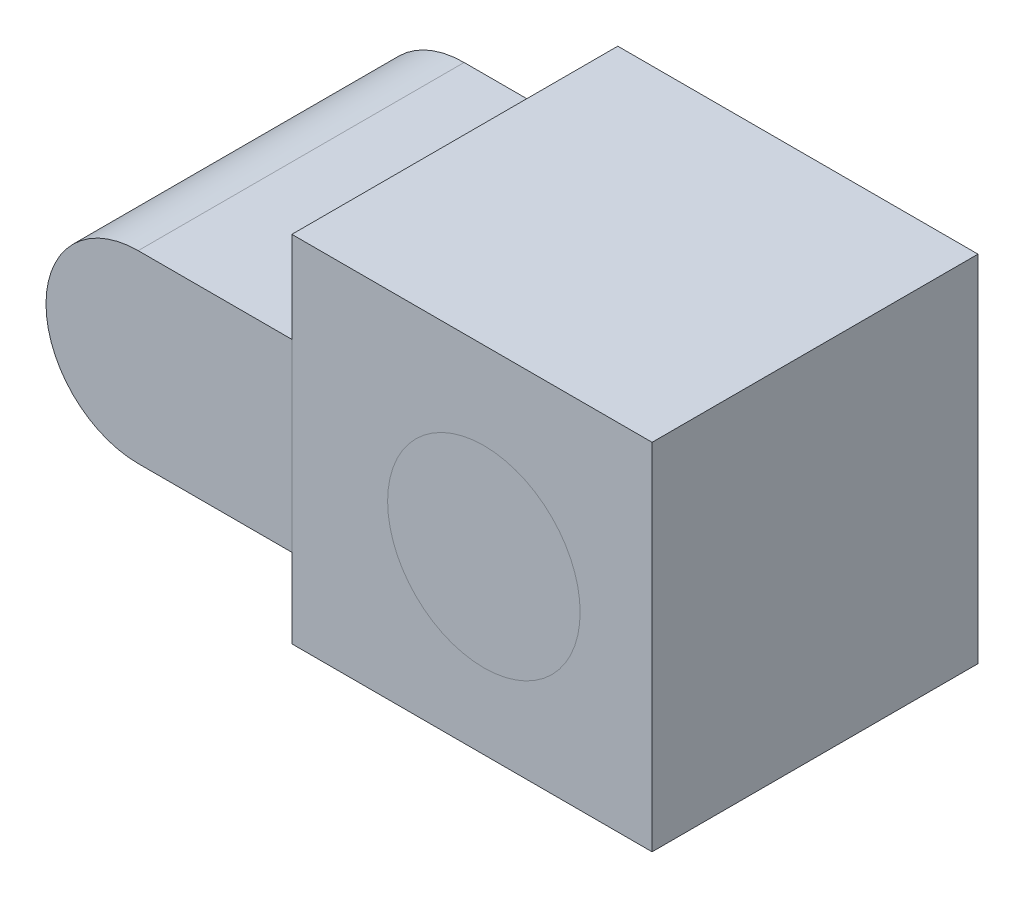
ISO-10303-21;
HEADER;
FILE_DESCRIPTION(('STEP AP214'),'2;1');
FILE_NAME('part.step','',(''),(''),'','','');
FILE_SCHEMA(('AUTOMOTIVE_DESIGN { 1 0 10303 214 1 1 1 1 }'));
ENDSEC;
DATA;
#1=APPLICATION_CONTEXT('core data for automotive mechanical design processes');
#2=APPLICATION_PROTOCOL_DEFINITION('international standard','automotive_design',2000,#1);
#3=PRODUCT_CONTEXT('',#1,'mechanical');
#4=PRODUCT('Part','Part','',(#3));
#5=PRODUCT_RELATED_PRODUCT_CATEGORY('part','',(#4));
#6=PRODUCT_DEFINITION_FORMATION('','',#4);
#7=PRODUCT_DEFINITION_CONTEXT('part definition',#1,'design');
#8=PRODUCT_DEFINITION('design','',#6,#7);
#9=PRODUCT_DEFINITION_SHAPE('','',#8);
#10=(LENGTH_UNIT() NAMED_UNIT(*) SI_UNIT(.MILLI.,.METRE.));
#11=(NAMED_UNIT(*) PLANE_ANGLE_UNIT() SI_UNIT($,.RADIAN.));
#12=(NAMED_UNIT(*) SI_UNIT($,.STERADIAN.) SOLID_ANGLE_UNIT());
#13=UNCERTAINTY_MEASURE_WITH_UNIT(LENGTH_MEASURE(1.E-05),#10,'distance_accuracy_value','');
#14=(GEOMETRIC_REPRESENTATION_CONTEXT(3) GLOBAL_UNCERTAINTY_ASSIGNED_CONTEXT((#13)) GLOBAL_UNIT_ASSIGNED_CONTEXT((#10,
#11,#12)) REPRESENTATION_CONTEXT('',''));
#15=CARTESIAN_POINT('',(0.,0.,0.));
#16=DIRECTION('',(0.,0.,1.));
#17=DIRECTION('',(1.,0.,0.));
#18=AXIS2_PLACEMENT_3D('',#15,#16,#17);
#19=CARTESIAN_POINT('',(38.3061852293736,34.2169341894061,-0.00999999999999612));
#20=DIRECTION('',(0.,0.,1.));
#21=DIRECTION('',(1.,0.,0.));
#22=AXIS2_PLACEMENT_3D('',#19,#20,#21);
#23=CYLINDRICAL_SURFACE('',#22,19.2044359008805);
#24=CARTESIAN_POINT('',(38.3061852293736,34.2169341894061,0.));
#25=DIRECTION('',(0.,0.,1.));
#26=DIRECTION('',(1.,0.,0.));
#27=AXIS2_PLACEMENT_3D('',#24,#25,#26);
#28=CIRCLE('',#27,19.2044359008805);
#29=CARTESIAN_POINT('',(57.5106211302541,34.2169341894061,0.));
#30=VERTEX_POINT('',#29);
#31=EDGE_CURVE('E39',#30,#30,#28,.T.);
#32=ORIENTED_EDGE('',*,*,#31,.T.);
#33=EDGE_LOOP('',(#32));
#34=FACE_BOUND('',#33,.T.);
#35=CARTESIAN_POINT('',(38.3061852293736,34.2169341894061,65.024));
#36=DIRECTION('',(0.,0.,1.));
#37=DIRECTION('',(1.,0.,0.));
#38=AXIS2_PLACEMENT_3D('',#35,#36,#37);
#39=CIRCLE('',#38,19.2044359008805);
#40=CARTESIAN_POINT('',(57.5106211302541,34.2169341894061,65.024));
#41=VERTEX_POINT('',#40);
#42=EDGE_CURVE('E11',#41,#41,#39,.T.);
#43=ORIENTED_EDGE('',*,*,#42,.F.);
#44=EDGE_LOOP('',(#43));
#45=FACE_BOUND('',#44,.T.);
#46=ADVANCED_FACE('F35',(#34,#45),#23,.T.);
#47=CARTESIAN_POINT('',(-30.6603352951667,34.2169341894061,0.));
#48=DIRECTION('',(0.,0.,1.));
#49=DIRECTION('',(1.,0.,0.));
#50=AXIS2_PLACEMENT_3D('',#47,#48,#49);
#51=PLANE('',#50);
#52=ORIENTED_EDGE('',*,*,#31,.F.);
#53=EDGE_LOOP('',(#52));
#54=FACE_BOUND('',#53,.T.);
#55=ADVANCED_FACE('F50',(#54),#51,.F.);
#56=CARTESIAN_POINT('',(-30.6603352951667,34.2169341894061,65.024));
#57=DIRECTION('',(0.,0.,1.));
#58=DIRECTION('',(1.,0.,0.));
#59=AXIS2_PLACEMENT_3D('',#56,#57,#58);
#60=PLANE('',#59);
#61=ORIENTED_EDGE('',*,*,#42,.T.);
#62=EDGE_LOOP('',(#61));
#63=FACE_BOUND('',#62,.T.);
#64=ADVANCED_FACE('F37',(#63),#60,.T.);
#65=CLOSED_SHELL('',(#46,#55,#64));
#66=MANIFOLD_SOLID_BREP('B2',#65);
#67=CARTESIAN_POINT('',(0.,52.6131353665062,0.));
#68=DIRECTION('',(-1.,0.,0.));
#69=DIRECTION('',(0.,0.,1.));
#70=AXIS2_PLACEMENT_3D('',#67,#68,#69);
#71=PLANE('',#70);
#72=DIRECTION('',(0.,-1.,0.));
#73=VECTOR('',#72,1.);
#74=CARTESIAN_POINT('',(0.,34.2169341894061,65.024));
#75=LINE('',#74,#73);
#76=CARTESIAN_POINT('',(0.,52.6131353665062,65.024));
#77=VERTEX_POINT('',#76);
#78=CARTESIAN_POINT('',(0.,15.820733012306,65.024));
#79=VERTEX_POINT('',#78);
#80=EDGE_CURVE('E125',#77,#79,#75,.T.);
#81=ORIENTED_EDGE('',*,*,#80,.T.);
#82=DIRECTION('',(0.,0.,-1.));
#83=VECTOR('',#82,1.);
#84=CARTESIAN_POINT('',(0.,15.820733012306,65.024));
#85=LINE('',#84,#83);
#86=CARTESIAN_POINT('',(0.,15.820733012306,0.));
#87=VERTEX_POINT('',#86);
#88=EDGE_CURVE('E82',#79,#87,#85,.T.);
#89=ORIENTED_EDGE('',*,*,#88,.T.);
#90=DIRECTION('',(0.,-1.,0.));
#91=VECTOR('',#90,1.);
#92=CARTESIAN_POINT('',(0.,34.2169341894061,0.));
#93=LINE('',#92,#91);
#94=CARTESIAN_POINT('',(0.,52.6131353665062,0.));
#95=VERTEX_POINT('',#94);
#96=EDGE_CURVE('E118',#95,#87,#93,.T.);
#97=ORIENTED_EDGE('',*,*,#96,.F.);
#98=DIRECTION('',(0.,0.,-1.));
#99=VECTOR('',#98,1.);
#100=CARTESIAN_POINT('',(0.,52.6131353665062,65.024));
#101=LINE('',#100,#99);
#102=EDGE_CURVE('E94',#77,#95,#101,.T.);
#103=ORIENTED_EDGE('',*,*,#102,.F.);
#104=EDGE_LOOP('',(#81,#89,#97,#103));
#105=FACE_BOUND('',#104,.T.);
#106=ADVANCED_FACE('F78',(#105),#71,.F.);
#107=CARTESIAN_POINT('',(-30.6603352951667,34.2169341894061,65.024));
#108=DIRECTION('',(0.,0.,-1.));
#109=DIRECTION('',(-1.,0.,0.));
#110=AXIS2_PLACEMENT_3D('',#107,#108,#109);
#111=CYLINDRICAL_SURFACE('',#110,18.3962011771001);
#112=CARTESIAN_POINT('',(-30.6603352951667,34.2169341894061,0.));
#113=DIRECTION('',(0.,0.,1.));
#114=DIRECTION('',(1.,0.,0.));
#115=AXIS2_PLACEMENT_3D('',#112,#113,#114);
#116=CIRCLE('',#115,18.3962011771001);
#117=CARTESIAN_POINT('',(-30.6603352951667,52.6131353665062,0.));
#118=VERTEX_POINT('',#117);
#119=CARTESIAN_POINT('',(-30.6603352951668,15.8207330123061,0.));
#120=VERTEX_POINT('',#119);
#121=EDGE_CURVE('E87',#118,#120,#116,.T.);
#122=ORIENTED_EDGE('',*,*,#121,.T.);
#123=DIRECTION('',(0.,0.,-1.));
#124=VECTOR('',#123,1.);
#125=CARTESIAN_POINT('',(-30.6603352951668,15.8207330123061,65.024));
#126=LINE('',#125,#124);
#127=CARTESIAN_POINT('',(-30.6603352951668,15.8207330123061,65.024));
#128=VERTEX_POINT('',#127);
#129=EDGE_CURVE('E135',#128,#120,#126,.T.);
#130=ORIENTED_EDGE('',*,*,#129,.F.);
#131=CARTESIAN_POINT('',(-30.6603352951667,34.2169341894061,65.024));
#132=DIRECTION('',(0.,0.,1.));
#133=DIRECTION('',(1.,0.,0.));
#134=AXIS2_PLACEMENT_3D('',#131,#132,#133);
#135=CIRCLE('',#134,18.3962011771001);
#136=CARTESIAN_POINT('',(-30.6603352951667,52.6131353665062,65.024));
#137=VERTEX_POINT('',#136);
#138=EDGE_CURVE('E139',#137,#128,#135,.T.);
#139=ORIENTED_EDGE('',*,*,#138,.F.);
#140=DIRECTION('',(0.,0.,-1.));
#141=VECTOR('',#140,1.);
#142=CARTESIAN_POINT('',(-30.6603352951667,52.6131353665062,65.024));
#143=LINE('',#142,#141);
#144=EDGE_CURVE('E143',#137,#118,#143,.T.);
#145=ORIENTED_EDGE('',*,*,#144,.T.);
#146=EDGE_LOOP('',(#122,#130,#139,#145));
#147=FACE_BOUND('',#146,.T.);
#148=ADVANCED_FACE('F151',(#147),#111,.T.);
#149=CARTESIAN_POINT('',(-30.6603352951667,15.820733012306,65.024));
#150=DIRECTION('',(0.,1.,0.));
#151=DIRECTION('',(0.,0.,1.));
#152=AXIS2_PLACEMENT_3D('',#149,#150,#151);
#153=PLANE('',#152);
#154=DIRECTION('',(1.,0.,0.));
#155=VECTOR('',#154,1.);
#156=CARTESIAN_POINT('',(-30.6603352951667,15.820733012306,0.));
#157=LINE('',#156,#155);
#158=EDGE_CURVE('E123',#120,#87,#157,.T.);
#159=ORIENTED_EDGE('',*,*,#158,.T.);
#160=ORIENTED_EDGE('',*,*,#88,.F.);
#161=DIRECTION('',(1.,0.,0.));
#162=VECTOR('',#161,1.);
#163=CARTESIAN_POINT('',(-30.6603352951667,15.820733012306,65.024));
#164=LINE('',#163,#162);
#165=EDGE_CURVE('E147',#128,#79,#164,.T.);
#166=ORIENTED_EDGE('',*,*,#165,.F.);
#167=ORIENTED_EDGE('',*,*,#129,.T.);
#168=EDGE_LOOP('',(#159,#160,#166,#167));
#169=FACE_BOUND('',#168,.T.);
#170=ADVANCED_FACE('F133',(#169),#153,.F.);
#171=CARTESIAN_POINT('',(0.,52.6131353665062,65.024));
#172=DIRECTION('',(0.,-1.,0.));
#173=DIRECTION('',(0.,0.,-1.));
#174=AXIS2_PLACEMENT_3D('',#171,#172,#173);
#175=PLANE('',#174);
#176=DIRECTION('',(-1.,0.,0.));
#177=VECTOR('',#176,1.);
#178=CARTESIAN_POINT('',(0.,52.6131353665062,0.));
#179=LINE('',#178,#177);
#180=EDGE_CURVE('E33',#95,#118,#179,.T.);
#181=ORIENTED_EDGE('',*,*,#180,.T.);
#182=ORIENTED_EDGE('',*,*,#144,.F.);
#183=DIRECTION('',(-1.,0.,0.));
#184=VECTOR('',#183,1.);
#185=CARTESIAN_POINT('',(0.,52.6131353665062,65.024));
#186=LINE('',#185,#184);
#187=EDGE_CURVE('E136',#77,#137,#186,.T.);
#188=ORIENTED_EDGE('',*,*,#187,.F.);
#189=ORIENTED_EDGE('',*,*,#102,.T.);
#190=EDGE_LOOP('',(#181,#182,#188,#189));
#191=FACE_BOUND('',#190,.T.);
#192=ADVANCED_FACE('F158',(#191),#175,.F.);
#193=CARTESIAN_POINT('',(-30.6603352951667,34.2169341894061,0.));
#194=DIRECTION('',(0.,0.,1.));
#195=DIRECTION('',(1.,0.,0.));
#196=AXIS2_PLACEMENT_3D('',#193,#194,#195);
#197=PLANE('',#196);
#198=ORIENTED_EDGE('',*,*,#180,.F.);
#199=ORIENTED_EDGE('',*,*,#96,.T.);
#200=ORIENTED_EDGE('',*,*,#158,.F.);
#201=ORIENTED_EDGE('',*,*,#121,.F.);
#202=EDGE_LOOP('',(#198,#199,#200,#201));
#203=FACE_BOUND('',#202,.T.);
#204=ADVANCED_FACE('F120',(#203),#197,.F.);
#205=CARTESIAN_POINT('',(-30.6603352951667,34.2169341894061,65.024));
#206=DIRECTION('',(0.,0.,1.));
#207=DIRECTION('',(1.,0.,0.));
#208=AXIS2_PLACEMENT_3D('',#205,#206,#207);
#209=PLANE('',#208);
#210=ORIENTED_EDGE('',*,*,#80,.F.);
#211=ORIENTED_EDGE('',*,*,#187,.T.);
#212=ORIENTED_EDGE('',*,*,#138,.T.);
#213=ORIENTED_EDGE('',*,*,#165,.T.);
#214=EDGE_LOOP('',(#210,#211,#212,#213));
#215=FACE_BOUND('',#214,.T.);
#216=ADVANCED_FACE('F80',(#215),#209,.T.);
#217=CLOSED_SHELL('',(#106,#148,#170,#192,#204,#216));
#218=MANIFOLD_SOLID_BREP('B6',#217);
#219=CARTESIAN_POINT('',(38.3061852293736,34.2169341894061,-0.00999999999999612));
#220=DIRECTION('',(0.,0.,1.));
#221=DIRECTION('',(1.,0.,0.));
#222=AXIS2_PLACEMENT_3D('',#219,#220,#221);
#223=CYLINDRICAL_SURFACE('',#222,19.2044359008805);
#224=CARTESIAN_POINT('',(38.3061852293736,34.2169341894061,65.024));
#225=DIRECTION('',(0.,0.,1.));
#226=DIRECTION('',(1.,0.,0.));
#227=AXIS2_PLACEMENT_3D('',#224,#225,#226);
#228=CIRCLE('',#227,19.2044359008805);
#229=CARTESIAN_POINT('',(57.5106211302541,34.2169341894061,65.024));
#230=VERTEX_POINT('',#229);
#231=EDGE_CURVE('E76',#230,#230,#228,.T.);
#232=ORIENTED_EDGE('',*,*,#231,.T.);
#233=EDGE_LOOP('',(#232));
#234=FACE_BOUND('',#233,.T.);
#235=CARTESIAN_POINT('',(38.3061852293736,34.2169341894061,0.));
#236=DIRECTION('',(0.,0.,1.));
#237=DIRECTION('',(1.,0.,0.));
#238=AXIS2_PLACEMENT_3D('',#235,#236,#237);
#239=CIRCLE('',#238,19.2044359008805);
#240=CARTESIAN_POINT('',(57.5106211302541,34.2169341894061,0.));
#241=VERTEX_POINT('',#240);
#242=EDGE_CURVE('E197',#241,#241,#239,.T.);
#243=ORIENTED_EDGE('',*,*,#242,.F.);
#244=EDGE_LOOP('',(#243));
#245=FACE_BOUND('',#244,.T.);
#246=ADVANCED_FACE('F189',(#234,#245),#223,.F.);
#247=CARTESIAN_POINT('',(0.,0.,65.024));
#248=DIRECTION('',(0.,1.,0.));
#249=DIRECTION('',(0.,0.,1.));
#250=AXIS2_PLACEMENT_3D('',#247,#248,#249);
#251=PLANE('',#250);
#252=DIRECTION('',(1.,0.,0.));
#253=VECTOR('',#252,1.);
#254=CARTESIAN_POINT('',(0.,0.,0.));
#255=LINE('',#254,#253);
#256=CARTESIAN_POINT('',(0.,0.,0.));
#257=VERTEX_POINT('',#256);
#258=CARTESIAN_POINT('',(71.8678259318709,0.,0.));
#259=VERTEX_POINT('',#258);
#260=EDGE_CURVE('E242',#257,#259,#255,.T.);
#261=ORIENTED_EDGE('',*,*,#260,.T.);
#262=DIRECTION('',(0.,0.,-1.));
#263=VECTOR('',#262,1.);
#264=CARTESIAN_POINT('',(71.8678259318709,0.,65.024));
#265=LINE('',#264,#263);
#266=CARTESIAN_POINT('',(71.8678259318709,0.,65.024));
#267=VERTEX_POINT('',#266);
#268=EDGE_CURVE('E250',#267,#259,#265,.T.);
#269=ORIENTED_EDGE('',*,*,#268,.F.);
#270=DIRECTION('',(1.,0.,0.));
#271=VECTOR('',#270,1.);
#272=CARTESIAN_POINT('',(0.,0.,65.024));
#273=LINE('',#272,#271);
#274=CARTESIAN_POINT('',(0.,0.,65.024));
#275=VERTEX_POINT('',#274);
#276=EDGE_CURVE('E249',#275,#267,#273,.T.);
#277=ORIENTED_EDGE('',*,*,#276,.F.);
#278=DIRECTION('',(0.,0.,-1.));
#279=VECTOR('',#278,1.);
#280=CARTESIAN_POINT('',(0.,0.,65.024));
#281=LINE('',#280,#279);
#282=EDGE_CURVE('E234',#275,#257,#281,.T.);
#283=ORIENTED_EDGE('',*,*,#282,.T.);
#284=EDGE_LOOP('',(#261,#269,#277,#283));
#285=FACE_BOUND('',#284,.T.);
#286=ADVANCED_FACE('F191',(#285),#251,.F.);
#287=CARTESIAN_POINT('',(71.8678259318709,0.,65.024));
#288=DIRECTION('',(-1.,0.,0.));
#289=DIRECTION('',(0.,0.,1.));
#290=AXIS2_PLACEMENT_3D('',#287,#288,#289);
#291=PLANE('',#290);
#292=DIRECTION('',(0.,1.,0.));
#293=VECTOR('',#292,1.);
#294=CARTESIAN_POINT('',(71.8678259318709,0.,0.));
#295=LINE('',#294,#293);
#296=CARTESIAN_POINT('',(71.8678259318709,70.7640538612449,0.));
#297=VERTEX_POINT('',#296);
#298=EDGE_CURVE('E244',#259,#297,#295,.T.);
#299=ORIENTED_EDGE('',*,*,#298,.T.);
#300=DIRECTION('',(0.,0.,-1.));
#301=VECTOR('',#300,1.);
#302=CARTESIAN_POINT('',(71.8678259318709,70.7640538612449,65.024));
#303=LINE('',#302,#301);
#304=CARTESIAN_POINT('',(71.8678259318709,70.7640538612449,65.024));
#305=VERTEX_POINT('',#304);
#306=EDGE_CURVE('E253',#305,#297,#303,.T.);
#307=ORIENTED_EDGE('',*,*,#306,.F.);
#308=DIRECTION('',(0.,1.,0.));
#309=VECTOR('',#308,1.);
#310=CARTESIAN_POINT('',(71.8678259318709,0.,65.024));
#311=LINE('',#310,#309);
#312=EDGE_CURVE('E211',#267,#305,#311,.T.);
#313=ORIENTED_EDGE('',*,*,#312,.F.);
#314=ORIENTED_EDGE('',*,*,#268,.T.);
#315=EDGE_LOOP('',(#299,#307,#313,#314));
#316=FACE_BOUND('',#315,.T.);
#317=ADVANCED_FACE('F266',(#316),#291,.F.);
#318=CARTESIAN_POINT('',(0.,70.7640538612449,65.024));
#319=DIRECTION('',(0.,-1.,0.));
#320=DIRECTION('',(0.,0.,-1.));
#321=AXIS2_PLACEMENT_3D('',#318,#319,#320);
#322=PLANE('',#321);
#323=DIRECTION('',(-1.,0.,0.));
#324=VECTOR('',#323,1.);
#325=CARTESIAN_POINT('',(0.,70.7640538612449,0.));
#326=LINE('',#325,#324);
#327=CARTESIAN_POINT('',(0.,70.7640538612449,0.));
#328=VERTEX_POINT('',#327);
#329=EDGE_CURVE('E239',#297,#328,#326,.T.);
#330=ORIENTED_EDGE('',*,*,#329,.T.);
#331=DIRECTION('',(0.,0.,-1.));
#332=VECTOR('',#331,1.);
#333=CARTESIAN_POINT('',(0.,70.7640538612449,65.024));
#334=LINE('',#333,#332);
#335=CARTESIAN_POINT('',(0.,70.7640538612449,65.024));
#336=VERTEX_POINT('',#335);
#337=EDGE_CURVE('E236',#336,#328,#334,.T.);
#338=ORIENTED_EDGE('',*,*,#337,.F.);
#339=DIRECTION('',(-1.,0.,0.));
#340=VECTOR('',#339,1.);
#341=CARTESIAN_POINT('',(0.,70.7640538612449,65.024));
#342=LINE('',#341,#340);
#343=EDGE_CURVE('E259',#305,#336,#342,.T.);
#344=ORIENTED_EDGE('',*,*,#343,.F.);
#345=ORIENTED_EDGE('',*,*,#306,.T.);
#346=EDGE_LOOP('',(#330,#338,#344,#345));
#347=FACE_BOUND('',#346,.T.);
#348=ADVANCED_FACE('F269',(#347),#322,.F.);
#349=CARTESIAN_POINT('',(-30.6603352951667,34.2169341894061,0.));
#350=DIRECTION('',(0.,0.,1.));
#351=DIRECTION('',(1.,0.,0.));
#352=AXIS2_PLACEMENT_3D('',#349,#350,#351);
#353=PLANE('',#352);
#354=ORIENTED_EDGE('',*,*,#242,.T.);
#355=EDGE_LOOP('',(#354));
#356=FACE_BOUND('',#355,.T.);
#357=ORIENTED_EDGE('',*,*,#260,.F.);
#358=DIRECTION('',(0.,-1.,0.));
#359=VECTOR('',#358,1.);
#360=CARTESIAN_POINT('',(0.,52.6131353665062,0.));
#361=LINE('',#360,#359);
#362=EDGE_CURVE('E230',#328,#257,#361,.T.);
#363=ORIENTED_EDGE('',*,*,#362,.F.);
#364=ORIENTED_EDGE('',*,*,#329,.F.);
#365=ORIENTED_EDGE('',*,*,#298,.F.);
#366=EDGE_LOOP('',(#357,#363,#364,#365));
#367=FACE_BOUND('',#366,.T.);
#368=ADVANCED_FACE('F243',(#356,#367),#353,.F.);
#369=CARTESIAN_POINT('',(-30.6603352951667,34.2169341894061,65.024));
#370=DIRECTION('',(0.,0.,1.));
#371=DIRECTION('',(1.,0.,0.));
#372=AXIS2_PLACEMENT_3D('',#369,#370,#371);
#373=PLANE('',#372);
#374=ORIENTED_EDGE('',*,*,#231,.F.);
#375=EDGE_LOOP('',(#374));
#376=FACE_BOUND('',#375,.T.);
#377=ORIENTED_EDGE('',*,*,#343,.T.);
#378=DIRECTION('',(0.,-1.,0.));
#379=VECTOR('',#378,1.);
#380=CARTESIAN_POINT('',(0.,0.,65.024));
#381=LINE('',#380,#379);
#382=EDGE_CURVE('E204',#336,#275,#381,.T.);
#383=ORIENTED_EDGE('',*,*,#382,.T.);
#384=ORIENTED_EDGE('',*,*,#276,.T.);
#385=ORIENTED_EDGE('',*,*,#312,.T.);
#386=EDGE_LOOP('',(#377,#383,#384,#385));
#387=FACE_BOUND('',#386,.T.);
#388=ADVANCED_FACE('F270',(#376,#387),#373,.T.);
#389=CARTESIAN_POINT('',(0.,52.6131353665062,65.024));
#390=DIRECTION('',(1.,0.,0.));
#391=DIRECTION('',(0.,0.,-1.));
#392=AXIS2_PLACEMENT_3D('',#389,#390,#391);
#393=PLANE('',#392);
#394=ORIENTED_EDGE('',*,*,#362,.T.);
#395=ORIENTED_EDGE('',*,*,#282,.F.);
#396=ORIENTED_EDGE('',*,*,#382,.F.);
#397=ORIENTED_EDGE('',*,*,#337,.T.);
#398=EDGE_LOOP('',(#394,#395,#396,#397));
#399=FACE_BOUND('',#398,.T.);
#400=ADVANCED_FACE('F232',(#399),#393,.F.);
#401=CLOSED_SHELL('',(#246,#286,#317,#348,#368,#388,#400));
#402=MANIFOLD_SOLID_BREP('B27',#401);
#403=ADVANCED_BREP_SHAPE_REPRESENTATION('',(#18,#66,#218,#402),#14);
#404=SHAPE_DEFINITION_REPRESENTATION(#9,#403);
ENDSEC;
END-ISO-10303-21;
